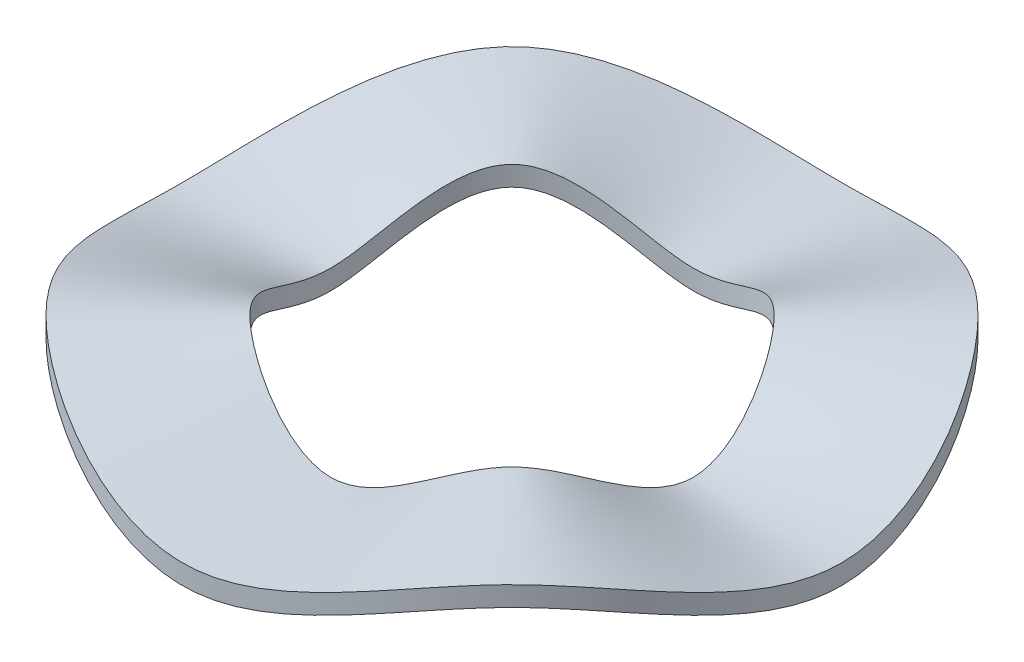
ISO-10303-21;
HEADER;
FILE_DESCRIPTION(('STEP AP214'),'2;1');
FILE_NAME('part.step','',(''),(''),'','','');
FILE_SCHEMA(('AUTOMOTIVE_DESIGN { 1 0 10303 214 1 1 1 1 }'));
ENDSEC;
DATA;
#1=APPLICATION_CONTEXT('core data for automotive mechanical design processes');
#2=APPLICATION_PROTOCOL_DEFINITION('international standard','automotive_design',2000,#1);
#3=PRODUCT_CONTEXT('',#1,'mechanical');
#4=PRODUCT('Part','Part','',(#3));
#5=PRODUCT_RELATED_PRODUCT_CATEGORY('part','',(#4));
#6=PRODUCT_DEFINITION_FORMATION('','',#4);
#7=PRODUCT_DEFINITION_CONTEXT('part definition',#1,'design');
#8=PRODUCT_DEFINITION('design','',#6,#7);
#9=PRODUCT_DEFINITION_SHAPE('','',#8);
#10=(LENGTH_UNIT() NAMED_UNIT(*) SI_UNIT(.MILLI.,.METRE.));
#11=(NAMED_UNIT(*) PLANE_ANGLE_UNIT() SI_UNIT($,.RADIAN.));
#12=(NAMED_UNIT(*) SI_UNIT($,.STERADIAN.) SOLID_ANGLE_UNIT());
#13=UNCERTAINTY_MEASURE_WITH_UNIT(LENGTH_MEASURE(1.E-05),#10,'distance_accuracy_value','');
#14=(GEOMETRIC_REPRESENTATION_CONTEXT(3) GLOBAL_UNCERTAINTY_ASSIGNED_CONTEXT((#13)) GLOBAL_UNIT_ASSIGNED_CONTEXT((#10,
#11,#12)) REPRESENTATION_CONTEXT('',''));
#15=CARTESIAN_POINT('',(0.,0.,0.));
#16=DIRECTION('',(0.,0.,1.));
#17=DIRECTION('',(1.,0.,0.));
#18=AXIS2_PLACEMENT_3D('',#15,#16,#17);
#19=CARTESIAN_POINT('',(13.97,0.,0.));
#20=CARTESIAN_POINT('',(13.969999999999,0.,-0.188853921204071));
#21=CARTESIAN_POINT('',(13.9634030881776,0.0190499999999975,-0.566561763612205));
#22=CARTESIAN_POINT('',(13.9337848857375,0.0990599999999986,-1.13220189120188));
#23=CARTESIAN_POINT('',(13.8845117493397,0.224789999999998,-1.69599874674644));
#24=CARTESIAN_POINT('',(13.4713507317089,1.2192,-5.06219043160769));
#25=CARTESIAN_POINT('',(10.5758195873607,6.858,-11.595111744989));
#26=CARTESIAN_POINT('',(-8.7959153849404E-11,-3.81000000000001,-15.2893823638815));
#27=CARTESIAN_POINT('',(-11.3312352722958,7.62,-11.3312352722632));
#28=CARTESIAN_POINT('',(-15.2893823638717,-3.80999999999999,-3.27185110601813E-12));
#29=CARTESIAN_POINT('',(-11.3312352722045,7.62,11.331235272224));
#30=CARTESIAN_POINT('',(2.29208470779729E-11,-3.81000000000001,15.2893823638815));
#31=CARTESIAN_POINT('',(10.5758195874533,6.858,11.5951117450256));
#32=CARTESIAN_POINT('',(13.4713507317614,1.21919999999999,5.06219043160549));
#33=CARTESIAN_POINT('',(13.8845117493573,0.224789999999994,1.69599874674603));
#34=CARTESIAN_POINT('',(13.9337848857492,0.0990599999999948,1.13220189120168));
#35=CARTESIAN_POINT('',(13.9634030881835,0.0190499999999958,0.566561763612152));
#36=CARTESIAN_POINT('',(13.970000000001,0.,0.188853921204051));
#37=CARTESIAN_POINT('',(13.97,0.,0.));
#38=CARTESIAN_POINT('',(14.9225,0.,0.));
#39=CARTESIAN_POINT('',(14.9224999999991,0.,-0.20076017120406));
#40=CARTESIAN_POINT('',(14.9153077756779,0.0190499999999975,-0.602280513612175));
#41=CARTESIAN_POINT('',(14.8830553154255,0.0990599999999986,-1.20359474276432));
#42=CARTESIAN_POINT('',(14.8294512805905,0.224789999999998,-1.80297640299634));
#43=CARTESIAN_POINT('',(14.3803929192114,1.2192,-5.38187324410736));
#44=CARTESIAN_POINT('',(11.2425695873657,6.858,-12.3332992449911));
#45=CARTESIAN_POINT('',(-8.0629947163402E-11,-3.81000000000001,-16.3609448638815));
#46=CARTESIAN_POINT('',(-12.0456102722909,7.62,-12.045610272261));
#47=CARTESIAN_POINT('',(-16.3609448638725,-3.80999999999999,-2.99949952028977E-12));
#48=CARTESIAN_POINT('',(-12.0456102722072,7.62,12.0456102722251));
#49=CARTESIAN_POINT('',(2.10104828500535E-11,-3.81000000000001,16.3609448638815));
#50=CARTESIAN_POINT('',(11.2425695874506,6.858,12.3332992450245));
#51=CARTESIAN_POINT('',(14.3803929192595,1.21919999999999,5.38187324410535));
#52=CARTESIAN_POINT('',(14.8294512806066,0.224789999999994,1.80297640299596));
#53=CARTESIAN_POINT('',(14.8830553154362,0.0990599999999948,1.20359474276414));
#54=CARTESIAN_POINT('',(14.9153077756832,0.0190499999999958,0.602280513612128));
#55=CARTESIAN_POINT('',(14.9225000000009,0.,0.200760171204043));
#56=CARTESIAN_POINT('',(14.9225,0.,0.));
#57=CARTESIAN_POINT('',(16.8275,0.,0.));
#58=CARTESIAN_POINT('',(16.8274999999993,0.,-0.224572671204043));
#59=CARTESIAN_POINT('',(16.8191171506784,0.0190499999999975,-0.673718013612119));
#60=CARTESIAN_POINT('',(16.7815961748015,0.0990599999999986,-1.3463804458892));
#61=CARTESIAN_POINT('',(16.7193303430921,0.224789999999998,-2.01693171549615));
#62=CARTESIAN_POINT('',(16.1984772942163,1.2192,-6.0212388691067));
#63=CARTESIAN_POINT('',(12.5760695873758,6.858,-13.8096742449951));
#64=CARTESIAN_POINT('',(-6.597066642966E-11,-3.81000000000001,-18.5040698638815));
#65=CARTESIAN_POINT('',(-13.4743602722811,7.62,-13.4743602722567));
#66=CARTESIAN_POINT('',(-18.5040698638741,-3.80999999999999,-2.45306162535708E-12));
#67=CARTESIAN_POINT('',(-13.4743602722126,7.62,13.4743602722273));
#68=CARTESIAN_POINT('',(1.71880196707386E-11,-3.81000000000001,18.5040698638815));
#69=CARTESIAN_POINT('',(12.5760695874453,6.858,13.8096742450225));
#70=CARTESIAN_POINT('',(16.1984772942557,1.21919999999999,6.02123886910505));
#71=CARTESIAN_POINT('',(16.7193303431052,0.224789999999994,2.01693171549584));
#72=CARTESIAN_POINT('',(16.7815961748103,0.0990599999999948,1.34638044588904));
#73=CARTESIAN_POINT('',(16.8191171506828,0.0190499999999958,0.673718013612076));
#74=CARTESIAN_POINT('',(16.8275000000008,0.,0.224572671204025));
#75=CARTESIAN_POINT('',(16.8275,0.,0.));
#76=CARTESIAN_POINT('',(19.685,0.,0.));
#77=CARTESIAN_POINT('',(19.6849999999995,0.,-0.260291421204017));
#78=CARTESIAN_POINT('',(19.6748312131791,0.0190499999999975,-0.780874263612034));
#79=CARTESIAN_POINT('',(19.6294074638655,0.0990599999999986,-1.56055900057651));
#80=CARTESIAN_POINT('',(19.5541489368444,0.224789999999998,-2.33786468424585));
#81=CARTESIAN_POINT('',(18.9256038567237,1.2192,-6.9802873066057));
#82=CARTESIAN_POINT('',(14.576319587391,6.858,-16.0242367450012));
#83=CARTESIAN_POINT('',(-4.3979576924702E-11,-3.81000000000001,-21.7187573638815));
#84=CARTESIAN_POINT('',(-15.6174852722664,7.62,-15.6174852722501));
#85=CARTESIAN_POINT('',(-21.7187573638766,-3.80999999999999,-1.63817527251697E-12));
#86=CARTESIAN_POINT('',(-15.6174852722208,7.62,15.6174852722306));
#87=CARTESIAN_POINT('',(1.14573606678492E-11,-3.81000000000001,21.7187573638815));
#88=CARTESIAN_POINT('',(14.5763195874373,6.858,16.0242367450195));
#89=CARTESIAN_POINT('',(18.92560385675,1.21919999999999,6.9802873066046));
#90=CARTESIAN_POINT('',(19.5541489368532,0.224789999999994,2.33786468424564));
#91=CARTESIAN_POINT('',(19.6294074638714,0.0990599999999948,1.5605590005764));
#92=CARTESIAN_POINT('',(19.674831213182,0.0190499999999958,0.780874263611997));
#93=CARTESIAN_POINT('',(19.6850000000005,0.,0.260291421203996));
#94=CARTESIAN_POINT('',(19.685,0.,0.));
#95=CARTESIAN_POINT('',(22.5425,0.,0.));
#96=CARTESIAN_POINT('',(22.5424999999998,0.,-0.296010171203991));
#97=CARTESIAN_POINT('',(22.5305452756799,0.0190499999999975,-0.888030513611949));
#98=CARTESIAN_POINT('',(22.4772187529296,0.0990599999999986,-1.77473755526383));
#99=CARTESIAN_POINT('',(22.3889675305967,0.224789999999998,-2.65879765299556));
#100=CARTESIAN_POINT('',(21.6527304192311,1.2192,-7.9393357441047));
#101=CARTESIAN_POINT('',(16.5765695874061,6.858,-18.2387992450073));
#102=CARTESIAN_POINT('',(-2.19936915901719E-11,-3.81000000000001,-24.9334448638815));
#103=CARTESIAN_POINT('',(-17.7606102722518,7.62,-17.7606102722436));
#104=CARTESIAN_POINT('',(-24.933444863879,-3.80999999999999,-8.1418162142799E-13));
#105=CARTESIAN_POINT('',(-17.7606102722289,7.62,17.7606102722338));
#106=CARTESIAN_POINT('',(5.71889540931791E-12,-3.81000000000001,24.9334448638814));
#107=CARTESIAN_POINT('',(16.5765695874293,6.858,18.2387992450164));
#108=CARTESIAN_POINT('',(21.6527304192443,1.21919999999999,7.93933574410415));
#109=CARTESIAN_POINT('',(22.3889675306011,0.224789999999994,2.65879765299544));
#110=CARTESIAN_POINT('',(22.4772187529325,0.0990599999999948,1.77473755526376));
#111=CARTESIAN_POINT('',(22.5305452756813,0.0190499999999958,0.888030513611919));
#112=CARTESIAN_POINT('',(22.5425000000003,0.,0.296010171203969));
#113=CARTESIAN_POINT('',(22.5425,0.,0.));
#114=CARTESIAN_POINT('',(24.4475,0.,0.));
#115=CARTESIAN_POINT('',(24.4474999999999,0.,-0.319822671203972));
#116=CARTESIAN_POINT('',(24.4343546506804,0.0190499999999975,-0.959468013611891));
#117=CARTESIAN_POINT('',(24.3757596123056,0.0990599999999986,-1.91752325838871));
#118=CARTESIAN_POINT('',(24.2788465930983,0.224789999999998,-2.87275296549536));
#119=CARTESIAN_POINT('',(23.4708147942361,1.2192,-8.57870136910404));
#120=CARTESIAN_POINT('',(17.9100695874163,6.858,-19.7151742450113));
#121=CARTESIAN_POINT('',(-7.32920668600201E-12,-3.81000000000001,-27.0765698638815));
#122=CARTESIAN_POINT('',(-19.189360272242,7.62,-19.1893602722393));
#123=CARTESIAN_POINT('',(-27.0765698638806,-3.80999999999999,-2.72947896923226E-13));
#124=CARTESIAN_POINT('',(-19.1893602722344,7.62,19.189360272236));
#125=CARTESIAN_POINT('',(1.90076903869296E-12,-3.81000000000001,27.0765698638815));
#126=CARTESIAN_POINT('',(17.910069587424,6.858,19.7151742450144));
#127=CARTESIAN_POINT('',(23.4708147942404,1.21919999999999,8.57870136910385));
#128=CARTESIAN_POINT('',(24.2788465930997,0.224789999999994,2.87275296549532));
#129=CARTESIAN_POINT('',(24.3757596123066,0.0990599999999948,1.91752325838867));
#130=CARTESIAN_POINT('',(24.4343546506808,0.0190499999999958,0.959468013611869));
#131=CARTESIAN_POINT('',(24.4475000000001,0.,0.319822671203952));
#132=CARTESIAN_POINT('',(24.4475,0.,0.));
#133=CARTESIAN_POINT('',(25.4,0.,0.));
#134=CARTESIAN_POINT('',(25.4,0.,-0.331728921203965));
#135=CARTESIAN_POINT('',(25.3862593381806,0.0190499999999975,-0.995186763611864));
#136=CARTESIAN_POINT('',(25.3250300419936,0.0990599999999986,-1.98891610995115));
#137=CARTESIAN_POINT('',(25.2237861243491,0.224789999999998,-2.97973062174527));
#138=CARTESIAN_POINT('',(24.3798569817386,1.2192,-8.89838418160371));
#139=CARTESIAN_POINT('',(18.5768195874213,6.858,-20.4533617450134));
#140=CARTESIAN_POINT('',(0.,-3.81000000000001,-28.1481323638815));
#141=CARTESIAN_POINT('',(-19.9037352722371,7.62,-19.9037352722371));
#142=CARTESIAN_POINT('',(-28.1481323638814,-3.80999999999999,0.));
#143=CARTESIAN_POINT('',(-19.9037352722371,7.62,19.9037352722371));
#144=CARTESIAN_POINT('',(0.,-3.81000000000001,28.1481323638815));
#145=CARTESIAN_POINT('',(18.5768195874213,6.858,20.4533617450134));
#146=CARTESIAN_POINT('',(24.3798569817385,1.21919999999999,8.8983841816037));
#147=CARTESIAN_POINT('',(25.2237861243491,0.224789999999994,2.97973062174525));
#148=CARTESIAN_POINT('',(25.3250300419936,0.0990599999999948,1.98891610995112));
#149=CARTESIAN_POINT('',(25.3862593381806,0.0190499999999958,0.995186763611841));
#150=CARTESIAN_POINT('',(25.4,0.,0.331728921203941));
#151=CARTESIAN_POINT('',(25.4,0.,0.));
#152=B_SPLINE_SURFACE_WITH_KNOTS('',3,3,((#19,#20,#21,#22,#23,#24,#25,#26,#27,#28,#29,#30,#31,
#32,#33,#34,#35,#36,#37),(#38,#39,#40,#41,#42,#43,#44,#45,#46,#47,#48,#49,#50,#51,#52,#53,#54,
#55,#56),(#57,#58,#59,#60,#61,#62,#63,#64,#65,#66,#67,#68,#69,#70,#71,#72,#73,#74,#75),(#76,#77,
#78,#79,#80,#81,#82,#83,#84,#85,#86,#87,#88,#89,#90,#91,#92,#93,#94),(#95,#96,#97,#98,#99,#100,
#101,#102,#103,#104,#105,#106,#107,#108,#109,#110,#111,#112,#113),(#114,#115,#116,#117,#118,
#119,#120,#121,#122,#123,#124,#125,#126,#127,#128,#129,#130,#131,#132),(#133,#134,#135,#136,
#137,#138,#139,#140,#141,#142,#143,#144,#145,#146,#147,#148,#149,#150,#151)),.UNSPECIFIED.,.F.,
.T.,.F.,(4,1,1,1,4),(4,1,1,1,1,1,1,1,1,1,1,1,1,1,1,1,4),(0.558823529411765,0.669117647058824,
0.779411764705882,0.889705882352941,1.),(0.,0.00625000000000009,0.0125,0.01875,
0.0249999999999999,0.125,0.25000000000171,0.375,0.5,0.625,0.750000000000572,0.875,0.975,0.98125,
0.9875,0.99375,1.),.UNSPECIFIED.);
#153=CARTESIAN_POINT('',(25.4,0.,0.));
#154=CARTESIAN_POINT('',(25.4,0.,-0.331728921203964));
#155=CARTESIAN_POINT('',(25.3862593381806,0.0190499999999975,-0.995186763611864));
#156=CARTESIAN_POINT('',(25.3250300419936,0.0990599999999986,-1.98891610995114));
#157=CARTESIAN_POINT('',(25.2237861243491,0.224789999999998,-2.97973062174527));
#158=CARTESIAN_POINT('',(24.3798569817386,1.2192,-8.89838418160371));
#159=CARTESIAN_POINT('',(18.5768195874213,6.858,-20.4533617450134));
#160=CARTESIAN_POINT('',(0.,-3.81000000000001,-28.1481323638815));
#161=CARTESIAN_POINT('',(-19.9037352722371,7.62,-19.9037352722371));
#162=CARTESIAN_POINT('',(-28.1481323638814,-3.80999999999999,0.));
#163=CARTESIAN_POINT('',(-19.9037352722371,7.62,19.9037352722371));
#164=CARTESIAN_POINT('',(0.,-3.81000000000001,28.1481323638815));
#165=CARTESIAN_POINT('',(18.5768195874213,6.858,20.4533617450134));
#166=CARTESIAN_POINT('',(24.3798569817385,1.21919999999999,8.8983841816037));
#167=CARTESIAN_POINT('',(25.2237861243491,0.224789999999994,2.97973062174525));
#168=CARTESIAN_POINT('',(25.3250300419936,0.0990599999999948,1.98891610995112));
#169=CARTESIAN_POINT('',(25.3862593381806,0.0190499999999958,0.995186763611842));
#170=CARTESIAN_POINT('',(25.4,0.,0.331728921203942));
#171=CARTESIAN_POINT('',(25.4,0.,0.));
#172=B_SPLINE_CURVE_WITH_KNOTS('',3,(#153,#154,#155,#156,#157,#158,#159,#160,#161,#162,#163,
#164,#165,#166,#167,#168,#169,#170,#171),.UNSPECIFIED.,.T.,.F.,(4,1,1,1,1,1,1,1,1,1,1,1,1,1,1,1,
4),(0.,0.00625000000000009,0.0125,0.01875,0.0249999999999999,0.125,0.25000000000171,0.375,0.5,
0.625,0.750000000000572,0.875,0.975,0.98125,0.9875,0.99375,1.),.UNSPECIFIED.);
#173=CARTESIAN_POINT('',(25.4,0.,0.));
#174=VERTEX_POINT('',#173);
#175=EDGE_CURVE('E11',#174,#174,#172,.T.);
#176=CARTESIAN_POINT('',(13.97,0.,0.));
#177=CARTESIAN_POINT('',(13.969999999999,0.,-0.188853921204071));
#178=CARTESIAN_POINT('',(13.9634030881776,0.0190499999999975,-0.566561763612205));
#179=CARTESIAN_POINT('',(13.9337848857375,0.0990599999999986,-1.13220189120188));
#180=CARTESIAN_POINT('',(13.8845117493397,0.224789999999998,-1.69599874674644));
#181=CARTESIAN_POINT('',(13.4713507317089,1.2192,-5.06219043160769));
#182=CARTESIAN_POINT('',(10.5758195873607,6.858,-11.595111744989));
#183=CARTESIAN_POINT('',(-8.7959153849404E-11,-3.81000000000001,-15.2893823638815));
#184=CARTESIAN_POINT('',(-11.3312352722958,7.62,-11.3312352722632));
#185=CARTESIAN_POINT('',(-15.2893823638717,-3.80999999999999,-3.27185110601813E-12));
#186=CARTESIAN_POINT('',(-11.3312352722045,7.62,11.331235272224));
#187=CARTESIAN_POINT('',(2.29208470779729E-11,-3.81000000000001,15.2893823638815));
#188=CARTESIAN_POINT('',(10.5758195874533,6.858,11.5951117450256));
#189=CARTESIAN_POINT('',(13.4713507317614,1.21919999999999,5.06219043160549));
#190=CARTESIAN_POINT('',(13.8845117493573,0.224789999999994,1.69599874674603));
#191=CARTESIAN_POINT('',(13.9337848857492,0.0990599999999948,1.13220189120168));
#192=CARTESIAN_POINT('',(13.9634030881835,0.0190499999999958,0.566561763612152));
#193=CARTESIAN_POINT('',(13.970000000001,0.,0.188853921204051));
#194=CARTESIAN_POINT('',(13.97,0.,0.));
#195=B_SPLINE_CURVE_WITH_KNOTS('',3,(#176,#177,#178,#179,#180,#181,#182,#183,#184,#185,#186,
#187,#188,#189,#190,#191,#192,#193,#194),.UNSPECIFIED.,.T.,.F.,(4,1,1,1,1,1,1,1,1,1,1,1,1,1,1,1,
4),(0.,0.00625000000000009,0.0125,0.01875,0.0249999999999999,0.125,0.25000000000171,0.375,0.5,
0.625,0.750000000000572,0.875,0.975,0.98125,0.9875,0.99375,1.),.UNSPECIFIED.);
#196=CARTESIAN_POINT('',(13.97,0.,0.));
#197=VERTEX_POINT('',#196);
#198=EDGE_CURVE('E42',#197,#197,#195,.T.);
#199=ORIENTED_EDGE('',*,*,#175,.T.);
#200=EDGE_LOOP('',(#199));
#201=FACE_BOUND('',#200,.T.);
#202=ORIENTED_EDGE('',*,*,#198,.F.);
#203=EDGE_LOOP('',(#202));
#204=FACE_BOUND('',#203,.T.);
#205=ADVANCED_FACE('F37',(#201,#204),#152,.T.);
#206=CARTESIAN_POINT('',(13.97,-1.524,0.));
#207=CARTESIAN_POINT('',(13.969999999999,-1.524,-0.18885392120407));
#208=CARTESIAN_POINT('',(13.9634030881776,-1.50495,-0.566561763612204));
#209=CARTESIAN_POINT('',(13.9337848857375,-1.42494,-1.13220189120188));
#210=CARTESIAN_POINT('',(13.8845117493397,-1.29921,-1.69599874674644));
#211=CARTESIAN_POINT('',(13.4713507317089,-0.3048,-5.06219043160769));
#212=CARTESIAN_POINT('',(10.5758195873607,5.334,-11.595111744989));
#213=CARTESIAN_POINT('',(-8.7959587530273E-11,-5.33400000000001,-15.2893823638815));
#214=CARTESIAN_POINT('',(-11.3312352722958,6.096,-11.3312352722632));
#215=CARTESIAN_POINT('',(-15.2893823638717,-5.33399999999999,-3.27098374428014E-12));
#216=CARTESIAN_POINT('',(-11.3312352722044,6.096,11.331235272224));
#217=CARTESIAN_POINT('',(2.29212807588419E-11,-5.33400000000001,15.2893823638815));
#218=CARTESIAN_POINT('',(10.5758195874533,5.334,11.5951117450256));
#219=CARTESIAN_POINT('',(13.4713507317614,-0.304800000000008,5.06219043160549));
#220=CARTESIAN_POINT('',(13.8845117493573,-1.29921000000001,1.69599874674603));
#221=CARTESIAN_POINT('',(13.9337848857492,-1.42494000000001,1.13220189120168));
#222=CARTESIAN_POINT('',(13.9634030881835,-1.50495,0.566561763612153));
#223=CARTESIAN_POINT('',(13.970000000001,-1.524,0.188853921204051));
#224=CARTESIAN_POINT('',(13.97,-1.524,0.));
#225=CARTESIAN_POINT('',(13.97,-1.397,0.));
#226=CARTESIAN_POINT('',(13.969999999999,-1.397,-0.18885392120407));
#227=CARTESIAN_POINT('',(13.9634030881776,-1.37795,-0.566561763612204));
#228=CARTESIAN_POINT('',(13.9337848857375,-1.29794,-1.13220189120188));
#229=CARTESIAN_POINT('',(13.8845117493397,-1.17221,-1.69599874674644));
#230=CARTESIAN_POINT('',(13.4713507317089,-0.1778,-5.06219043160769));
#231=CARTESIAN_POINT('',(10.5758195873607,5.461,-11.595111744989));
#232=CARTESIAN_POINT('',(-8.7959587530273E-11,-5.20700000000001,-15.2893823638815));
#233=CARTESIAN_POINT('',(-11.3312352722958,6.223,-11.3312352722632));
#234=CARTESIAN_POINT('',(-15.2893823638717,-5.20699999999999,-3.27098374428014E-12));
#235=CARTESIAN_POINT('',(-11.3312352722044,6.223,11.331235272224));
#236=CARTESIAN_POINT('',(2.29212807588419E-11,-5.20700000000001,15.2893823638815));
#237=CARTESIAN_POINT('',(10.5758195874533,5.461,11.5951117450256));
#238=CARTESIAN_POINT('',(13.4713507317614,-0.177800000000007,5.06219043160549));
#239=CARTESIAN_POINT('',(13.8845117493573,-1.17221000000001,1.69599874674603));
#240=CARTESIAN_POINT('',(13.9337848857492,-1.29794,1.13220189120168));
#241=CARTESIAN_POINT('',(13.9634030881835,-1.37795,0.566561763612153));
#242=CARTESIAN_POINT('',(13.970000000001,-1.397,0.188853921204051));
#243=CARTESIAN_POINT('',(13.97,-1.397,0.));
#244=CARTESIAN_POINT('',(13.97,-1.143,0.));
#245=CARTESIAN_POINT('',(13.9699999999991,-1.143,-0.188853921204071));
#246=CARTESIAN_POINT('',(13.9634030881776,-1.12395,-0.566561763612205));
#247=CARTESIAN_POINT('',(13.9337848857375,-1.04394,-1.13220189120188));
#248=CARTESIAN_POINT('',(13.8845117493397,-0.918210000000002,-1.69599874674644));
#249=CARTESIAN_POINT('',(13.4713507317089,0.0761999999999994,-5.06219043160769));
#250=CARTESIAN_POINT('',(10.5758195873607,5.715,-11.5951117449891));
#251=CARTESIAN_POINT('',(-8.7960454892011E-11,-4.95300000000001,-15.2893823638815));
#252=CARTESIAN_POINT('',(-11.3312352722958,6.477,-11.3312352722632));
#253=CARTESIAN_POINT('',(-15.2893823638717,-4.95299999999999,-3.27098374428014E-12));
#254=CARTESIAN_POINT('',(-11.3312352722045,6.477,11.331235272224));
#255=CARTESIAN_POINT('',(2.29199797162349E-11,-4.95300000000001,15.2893823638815));
#256=CARTESIAN_POINT('',(10.5758195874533,5.715,11.5951117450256));
#257=CARTESIAN_POINT('',(13.4713507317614,0.076199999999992,5.0621904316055));
#258=CARTESIAN_POINT('',(13.8845117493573,-0.918210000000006,1.69599874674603));
#259=CARTESIAN_POINT('',(13.9337848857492,-1.04394000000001,1.13220189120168));
#260=CARTESIAN_POINT('',(13.9634030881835,-1.12395000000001,0.566561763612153));
#261=CARTESIAN_POINT('',(13.970000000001,-1.143,0.188853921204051));
#262=CARTESIAN_POINT('',(13.97,-1.143,0.));
#263=CARTESIAN_POINT('',(13.97,-0.762000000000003,0.));
#264=CARTESIAN_POINT('',(13.969999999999,-0.762000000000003,-0.18885392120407));
#265=CARTESIAN_POINT('',(13.9634030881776,-0.742950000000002,-0.566561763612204));
#266=CARTESIAN_POINT('',(13.9337848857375,-0.662940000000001,-1.13220189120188));
#267=CARTESIAN_POINT('',(13.8845117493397,-0.537210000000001,-1.69599874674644));
#268=CARTESIAN_POINT('',(13.4713507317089,0.4572,-5.06219043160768));
#269=CARTESIAN_POINT('',(10.5758195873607,6.096,-11.595111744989));
#270=CARTESIAN_POINT('',(-8.7959587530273E-11,-4.57200000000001,-15.2893823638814));
#271=CARTESIAN_POINT('',(-11.3312352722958,6.858,-11.3312352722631));
#272=CARTESIAN_POINT('',(-15.2893823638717,-4.57199999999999,-3.27185110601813E-12));
#273=CARTESIAN_POINT('',(-11.3312352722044,6.858,11.331235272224));
#274=CARTESIAN_POINT('',(2.29217144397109E-11,-4.57200000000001,15.2893823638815));
#275=CARTESIAN_POINT('',(10.5758195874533,6.096,11.5951117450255));
#276=CARTESIAN_POINT('',(13.4713507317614,0.457199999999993,5.06219043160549));
#277=CARTESIAN_POINT('',(13.8845117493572,-0.537210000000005,1.69599874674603));
#278=CARTESIAN_POINT('',(13.9337848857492,-0.662940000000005,1.13220189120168));
#279=CARTESIAN_POINT('',(13.9634030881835,-0.742950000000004,0.566561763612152));
#280=CARTESIAN_POINT('',(13.970000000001,-0.762000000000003,0.188853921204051));
#281=CARTESIAN_POINT('',(13.97,-0.762000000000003,0.));
#282=CARTESIAN_POINT('',(13.97,-0.381000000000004,0.));
#283=CARTESIAN_POINT('',(13.969999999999,-0.381000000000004,-0.18885392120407));
#284=CARTESIAN_POINT('',(13.9634030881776,-0.361950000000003,-0.566561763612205));
#285=CARTESIAN_POINT('',(13.9337848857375,-0.281940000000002,-1.13220189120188));
#286=CARTESIAN_POINT('',(13.8845117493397,-0.156210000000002,-1.69599874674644));
#287=CARTESIAN_POINT('',(13.4713507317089,0.8382,-5.0621904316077));
#288=CARTESIAN_POINT('',(10.5758195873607,6.477,-11.5951117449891));
#289=CARTESIAN_POINT('',(-8.7959587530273E-11,-4.19100000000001,-15.2893823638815));
#290=CARTESIAN_POINT('',(-11.3312352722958,7.239,-11.3312352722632));
#291=CARTESIAN_POINT('',(-15.2893823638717,-4.19099999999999,-3.27055006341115E-12));
#292=CARTESIAN_POINT('',(-11.3312352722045,7.239,11.331235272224));
#293=CARTESIAN_POINT('',(2.29208470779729E-11,-4.19100000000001,15.2893823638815));
#294=CARTESIAN_POINT('',(10.5758195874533,6.477,11.5951117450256));
#295=CARTESIAN_POINT('',(13.4713507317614,0.838199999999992,5.0621904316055));
#296=CARTESIAN_POINT('',(13.8845117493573,-0.156210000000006,1.69599874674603));
#297=CARTESIAN_POINT('',(13.9337848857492,-0.281940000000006,1.13220189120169));
#298=CARTESIAN_POINT('',(13.9634030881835,-0.361950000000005,0.566561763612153));
#299=CARTESIAN_POINT('',(13.970000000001,-0.381000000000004,0.188853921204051));
#300=CARTESIAN_POINT('',(13.97,-0.381000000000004,0.));
#301=CARTESIAN_POINT('',(13.97,-0.127000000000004,0.));
#302=CARTESIAN_POINT('',(13.969999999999,-0.127000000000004,-0.188853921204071));
#303=CARTESIAN_POINT('',(13.9634030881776,-0.107950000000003,-0.566561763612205));
#304=CARTESIAN_POINT('',(13.9337848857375,-0.0279400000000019,-1.13220189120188));
#305=CARTESIAN_POINT('',(13.8845117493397,0.0977899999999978,-1.69599874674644));
#306=CARTESIAN_POINT('',(13.4713507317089,1.0922,-5.06219043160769));
#307=CARTESIAN_POINT('',(10.5758195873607,6.731,-11.595111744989));
#308=CARTESIAN_POINT('',(-8.7959153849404E-11,-3.93700000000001,-15.2893823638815));
#309=CARTESIAN_POINT('',(-11.3312352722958,7.493,-11.3312352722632));
#310=CARTESIAN_POINT('',(-15.2893823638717,-3.93699999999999,-3.27185110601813E-12));
#311=CARTESIAN_POINT('',(-11.3312352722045,7.493,11.331235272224));
#312=CARTESIAN_POINT('',(2.29208470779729E-11,-3.93700000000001,15.2893823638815));
#313=CARTESIAN_POINT('',(10.5758195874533,6.731,11.5951117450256));
#314=CARTESIAN_POINT('',(13.4713507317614,1.09219999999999,5.06219043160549));
#315=CARTESIAN_POINT('',(13.8845117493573,0.0977899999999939,1.69599874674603));
#316=CARTESIAN_POINT('',(13.9337848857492,-0.0279400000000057,1.13220189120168));
#317=CARTESIAN_POINT('',(13.9634030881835,-0.107950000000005,0.566561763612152));
#318=CARTESIAN_POINT('',(13.970000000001,-0.127000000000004,0.188853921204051));
#319=CARTESIAN_POINT('',(13.97,-0.127000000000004,0.));
#320=CARTESIAN_POINT('',(13.97,0.,0.));
#321=CARTESIAN_POINT('',(13.969999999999,0.,-0.188853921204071));
#322=CARTESIAN_POINT('',(13.9634030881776,0.0190499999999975,-0.566561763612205));
#323=CARTESIAN_POINT('',(13.9337848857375,0.0990599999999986,-1.13220189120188));
#324=CARTESIAN_POINT('',(13.8845117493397,0.224789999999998,-1.69599874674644));
#325=CARTESIAN_POINT('',(13.4713507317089,1.2192,-5.06219043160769));
#326=CARTESIAN_POINT('',(10.5758195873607,6.858,-11.595111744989));
#327=CARTESIAN_POINT('',(-8.7959153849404E-11,-3.81000000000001,-15.2893823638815));
#328=CARTESIAN_POINT('',(-11.3312352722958,7.62,-11.3312352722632));
#329=CARTESIAN_POINT('',(-15.2893823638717,-3.80999999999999,-3.27185110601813E-12));
#330=CARTESIAN_POINT('',(-11.3312352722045,7.62,11.331235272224));
#331=CARTESIAN_POINT('',(2.29208470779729E-11,-3.81000000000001,15.2893823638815));
#332=CARTESIAN_POINT('',(10.5758195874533,6.858,11.5951117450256));
#333=CARTESIAN_POINT('',(13.4713507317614,1.21919999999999,5.06219043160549));
#334=CARTESIAN_POINT('',(13.8845117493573,0.224789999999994,1.69599874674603));
#335=CARTESIAN_POINT('',(13.9337848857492,0.0990599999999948,1.13220189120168));
#336=CARTESIAN_POINT('',(13.9634030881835,0.0190499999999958,0.566561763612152));
#337=CARTESIAN_POINT('',(13.970000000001,0.,0.188853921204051));
#338=CARTESIAN_POINT('',(13.97,0.,0.));
#339=B_SPLINE_SURFACE_WITH_KNOTS('',3,3,((#206,#207,#208,#209,#210,#211,#212,#213,#214,#215,
#216,#217,#218,#219,#220,#221,#222,#223,#224),(#225,#226,#227,#228,#229,#230,#231,#232,#233,
#234,#235,#236,#237,#238,#239,#240,#241,#242,#243),(#244,#245,#246,#247,#248,#249,#250,#251,
#252,#253,#254,#255,#256,#257,#258,#259,#260,#261,#262),(#263,#264,#265,#266,#267,#268,#269,
#270,#271,#272,#273,#274,#275,#276,#277,#278,#279,#280,#281),(#282,#283,#284,#285,#286,#287,
#288,#289,#290,#291,#292,#293,#294,#295,#296,#297,#298,#299,#300),(#301,#302,#303,#304,#305,
#306,#307,#308,#309,#310,#311,#312,#313,#314,#315,#316,#317,#318,#319),(#320,#321,#322,#323,
#324,#325,#326,#327,#328,#329,#330,#331,#332,#333,#334,#335,#336,#337,#338)),.UNSPECIFIED.,.F.,
.T.,.F.,(4,1,1,1,4),(4,1,1,1,1,1,1,1,1,1,1,1,1,1,1,1,4),(0.5,0.514705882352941,
0.529411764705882,0.544117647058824,0.558823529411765),(0.,0.00625000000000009,0.0125,0.01875,
0.0249999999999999,0.125,0.25000000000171,0.375,0.5,0.625,0.750000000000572,0.875,0.975,0.98125,
0.9875,0.99375,1.),.UNSPECIFIED.);
#340=CARTESIAN_POINT('',(13.97,-1.524,0.));
#341=CARTESIAN_POINT('',(13.969999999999,-1.524,-0.18885392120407));
#342=CARTESIAN_POINT('',(13.9634030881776,-1.50495,-0.566561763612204));
#343=CARTESIAN_POINT('',(13.9337848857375,-1.42494,-1.13220189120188));
#344=CARTESIAN_POINT('',(13.8845117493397,-1.29921,-1.69599874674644));
#345=CARTESIAN_POINT('',(13.4713507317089,-0.3048,-5.06219043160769));
#346=CARTESIAN_POINT('',(10.5758195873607,5.334,-11.595111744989));
#347=CARTESIAN_POINT('',(-8.7959587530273E-11,-5.33400000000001,-15.2893823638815));
#348=CARTESIAN_POINT('',(-11.3312352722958,6.096,-11.3312352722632));
#349=CARTESIAN_POINT('',(-15.2893823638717,-5.33399999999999,-3.27098374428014E-12));
#350=CARTESIAN_POINT('',(-11.3312352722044,6.096,11.331235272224));
#351=CARTESIAN_POINT('',(2.29212807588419E-11,-5.33400000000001,15.2893823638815));
#352=CARTESIAN_POINT('',(10.5758195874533,5.334,11.5951117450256));
#353=CARTESIAN_POINT('',(13.4713507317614,-0.304800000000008,5.06219043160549));
#354=CARTESIAN_POINT('',(13.8845117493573,-1.29921000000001,1.69599874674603));
#355=CARTESIAN_POINT('',(13.9337848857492,-1.42494000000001,1.13220189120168));
#356=CARTESIAN_POINT('',(13.9634030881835,-1.50495,0.566561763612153));
#357=CARTESIAN_POINT('',(13.970000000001,-1.524,0.188853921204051));
#358=CARTESIAN_POINT('',(13.97,-1.524,0.));
#359=B_SPLINE_CURVE_WITH_KNOTS('',3,(#340,#341,#342,#343,#344,#345,#346,#347,#348,#349,#350,
#351,#352,#353,#354,#355,#356,#357,#358),.UNSPECIFIED.,.T.,.F.,(4,1,1,1,1,1,1,1,1,1,1,1,1,1,1,1,
4),(0.,0.00625000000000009,0.0125,0.01875,0.0249999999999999,0.125,0.25000000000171,0.375,0.5,
0.625,0.750000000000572,0.875,0.975,0.98125,0.9875,0.99375,1.),.UNSPECIFIED.);
#360=CARTESIAN_POINT('',(13.97,-1.524,0.));
#361=VERTEX_POINT('',#360);
#362=EDGE_CURVE('E52',#361,#361,#359,.T.);
#363=ORIENTED_EDGE('',*,*,#198,.T.);
#364=EDGE_LOOP('',(#363));
#365=FACE_BOUND('',#364,.T.);
#366=ORIENTED_EDGE('',*,*,#362,.F.);
#367=EDGE_LOOP('',(#366));
#368=FACE_BOUND('',#367,.T.);
#369=ADVANCED_FACE('F77',(#365,#368),#339,.T.);
#370=CARTESIAN_POINT('',(25.4,-1.524,0.));
#371=CARTESIAN_POINT('',(25.4,-1.524,-0.331728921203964));
#372=CARTESIAN_POINT('',(25.3862593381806,-1.50495,-0.995186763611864));
#373=CARTESIAN_POINT('',(25.3250300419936,-1.42494,-1.98891610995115));
#374=CARTESIAN_POINT('',(25.2237861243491,-1.29921,-2.97973062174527));
#375=CARTESIAN_POINT('',(24.3798569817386,-0.3048,-8.89838418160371));
#376=CARTESIAN_POINT('',(18.5768195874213,5.334,-20.4533617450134));
#377=CARTESIAN_POINT('',(0.,-5.33400000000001,-28.1481323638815));
#378=CARTESIAN_POINT('',(-19.9037352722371,6.096,-19.9037352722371));
#379=CARTESIAN_POINT('',(-28.1481323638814,-5.33399999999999,0.));
#380=CARTESIAN_POINT('',(-19.9037352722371,6.096,19.9037352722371));
#381=CARTESIAN_POINT('',(0.,-5.33400000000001,28.1481323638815));
#382=CARTESIAN_POINT('',(18.5768195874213,5.334,20.4533617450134));
#383=CARTESIAN_POINT('',(24.3798569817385,-0.304800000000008,8.8983841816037));
#384=CARTESIAN_POINT('',(25.2237861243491,-1.29921000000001,2.97973062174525));
#385=CARTESIAN_POINT('',(25.3250300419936,-1.42494000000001,1.98891610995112));
#386=CARTESIAN_POINT('',(25.3862593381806,-1.50495,0.995186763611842));
#387=CARTESIAN_POINT('',(25.4,-1.524,0.331728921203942));
#388=CARTESIAN_POINT('',(25.4,-1.524,0.));
#389=CARTESIAN_POINT('',(24.4475,-1.524,0.));
#390=CARTESIAN_POINT('',(24.4474999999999,-1.524,-0.319822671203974));
#391=CARTESIAN_POINT('',(24.4343546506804,-1.50495,-0.959468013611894));
#392=CARTESIAN_POINT('',(24.3757596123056,-1.42494,-1.91752325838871));
#393=CARTESIAN_POINT('',(24.2788465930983,-1.29921,-2.87275296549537));
#394=CARTESIAN_POINT('',(23.4708147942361,-0.3048,-8.57870136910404));
#395=CARTESIAN_POINT('',(17.9100695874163,5.334,-19.7151742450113));
#396=CARTESIAN_POINT('',(-7.33180877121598E-12,-5.33400000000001,-27.0765698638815));
#397=CARTESIAN_POINT('',(-19.189360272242,6.096,-19.1893602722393));
#398=CARTESIAN_POINT('',(-27.0765698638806,-5.33399999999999,-2.70345811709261E-13));
#399=CARTESIAN_POINT('',(-19.1893602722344,6.096,19.189360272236));
#400=CARTESIAN_POINT('',(1.89990167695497E-12,-5.33400000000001,27.0765698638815));
#401=CARTESIAN_POINT('',(17.910069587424,5.334,19.7151742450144));
#402=CARTESIAN_POINT('',(23.4708147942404,-0.304800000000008,8.57870136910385));
#403=CARTESIAN_POINT('',(24.2788465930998,-1.29921000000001,2.87275296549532));
#404=CARTESIAN_POINT('',(24.3757596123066,-1.42494000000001,1.91752325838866));
#405=CARTESIAN_POINT('',(24.4343546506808,-1.50495,0.959468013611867));
#406=CARTESIAN_POINT('',(24.4475000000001,-1.524,0.31982267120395));
#407=CARTESIAN_POINT('',(24.4475,-1.524,0.));
#408=CARTESIAN_POINT('',(22.5425,-1.524,0.));
#409=CARTESIAN_POINT('',(22.5424999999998,-1.524,-0.296010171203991));
#410=CARTESIAN_POINT('',(22.5305452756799,-1.50495,-0.88803051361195));
#411=CARTESIAN_POINT('',(22.4772187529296,-1.42494,-1.77473755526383));
#412=CARTESIAN_POINT('',(22.3889675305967,-1.29921,-2.65879765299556));
#413=CARTESIAN_POINT('',(21.6527304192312,-0.3048,-7.93933574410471));
#414=CARTESIAN_POINT('',(16.5765695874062,5.334,-18.2387992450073));
#415=CARTESIAN_POINT('',(-2.19936915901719E-11,-5.33400000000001,-24.9334448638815));
#416=CARTESIAN_POINT('',(-17.7606102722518,6.096,-17.7606102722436));
#417=CARTESIAN_POINT('',(-24.933444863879,-5.33399999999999,-8.15048983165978E-13));
#418=CARTESIAN_POINT('',(-17.7606102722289,6.096,17.7606102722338));
#419=CARTESIAN_POINT('',(5.72063013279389E-12,-5.33400000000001,24.9334448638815));
#420=CARTESIAN_POINT('',(16.5765695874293,5.334,18.2387992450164));
#421=CARTESIAN_POINT('',(21.6527304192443,-0.304800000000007,7.93933574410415));
#422=CARTESIAN_POINT('',(22.3889675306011,-1.29921000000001,2.65879765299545));
#423=CARTESIAN_POINT('',(22.4772187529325,-1.42494,1.77473755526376));
#424=CARTESIAN_POINT('',(22.5305452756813,-1.50495,0.888030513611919));
#425=CARTESIAN_POINT('',(22.5425000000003,-1.524,0.296010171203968));
#426=CARTESIAN_POINT('',(22.5425,-1.524,0.));
#427=CARTESIAN_POINT('',(19.685,-1.524,0.));
#428=CARTESIAN_POINT('',(19.6849999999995,-1.524,-0.260291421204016));
#429=CARTESIAN_POINT('',(19.6748312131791,-1.50495,-0.780874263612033));
#430=CARTESIAN_POINT('',(19.6294074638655,-1.42494,-1.56055900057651));
#431=CARTESIAN_POINT('',(19.5541489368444,-1.29921,-2.33786468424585));
#432=CARTESIAN_POINT('',(18.9256038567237,-0.304800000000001,-6.9802873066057));
#433=CARTESIAN_POINT('',(14.576319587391,5.334,-16.0242367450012));
#434=CARTESIAN_POINT('',(-4.3979576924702E-11,-5.33400000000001,-21.7187573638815));
#435=CARTESIAN_POINT('',(-15.6174852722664,6.096,-15.6174852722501));
#436=CARTESIAN_POINT('',(-21.7187573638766,-5.33399999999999,-1.636440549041E-12));
#437=CARTESIAN_POINT('',(-15.6174852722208,6.096,15.6174852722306));
#438=CARTESIAN_POINT('',(1.14569269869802E-11,-5.33400000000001,21.7187573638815));
#439=CARTESIAN_POINT('',(14.5763195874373,5.334,16.0242367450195));
#440=CARTESIAN_POINT('',(18.92560385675,-0.304800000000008,6.9802873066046));
#441=CARTESIAN_POINT('',(19.5541489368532,-1.29921000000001,2.33786468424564));
#442=CARTESIAN_POINT('',(19.6294074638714,-1.42494000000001,1.5605590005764));
#443=CARTESIAN_POINT('',(19.674831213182,-1.50495,0.780874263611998));
#444=CARTESIAN_POINT('',(19.6850000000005,-1.524,0.260291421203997));
#445=CARTESIAN_POINT('',(19.685,-1.524,0.));
#446=CARTESIAN_POINT('',(16.8275,-1.524,0.));
#447=CARTESIAN_POINT('',(16.8274999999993,-1.524,-0.224572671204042));
#448=CARTESIAN_POINT('',(16.8191171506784,-1.50495,-0.673718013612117));
#449=CARTESIAN_POINT('',(16.7815961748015,-1.42494,-1.34638044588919));
#450=CARTESIAN_POINT('',(16.719330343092,-1.29921,-2.01693171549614));
#451=CARTESIAN_POINT('',(16.1984772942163,-0.3048,-6.02123886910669));
#452=CARTESIAN_POINT('',(12.5760695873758,5.334,-13.8096742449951));
#453=CARTESIAN_POINT('',(-6.597066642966E-11,-5.33400000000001,-18.5040698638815));
#454=CARTESIAN_POINT('',(-13.4743602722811,6.096,-13.4743602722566));
#455=CARTESIAN_POINT('',(-18.5040698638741,-5.33399999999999,-2.45306162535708E-12));
#456=CARTESIAN_POINT('',(-13.4743602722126,6.096,13.4743602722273));
#457=CARTESIAN_POINT('',(1.71867186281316E-11,-5.33400000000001,18.5040698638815));
#458=CARTESIAN_POINT('',(12.5760695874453,5.334,13.8096742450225));
#459=CARTESIAN_POINT('',(16.1984772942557,-0.304800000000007,6.02123886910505));
#460=CARTESIAN_POINT('',(16.7193303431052,-1.29921000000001,2.01693171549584));
#461=CARTESIAN_POINT('',(16.7815961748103,-1.42494000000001,1.34638044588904));
#462=CARTESIAN_POINT('',(16.8191171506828,-1.50495,0.673718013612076));
#463=CARTESIAN_POINT('',(16.8275000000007,-1.524,0.224572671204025));
#464=CARTESIAN_POINT('',(16.8275,-1.524,0.));
#465=CARTESIAN_POINT('',(14.9225,-1.524,0.));
#466=CARTESIAN_POINT('',(14.9224999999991,-1.524,-0.20076017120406));
#467=CARTESIAN_POINT('',(14.9153077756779,-1.50495,-0.602280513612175));
#468=CARTESIAN_POINT('',(14.8830553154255,-1.42494,-1.20359474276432));
#469=CARTESIAN_POINT('',(14.8294512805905,-1.29921,-1.80297640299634));
#470=CARTESIAN_POINT('',(14.3803929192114,-0.3048,-5.38187324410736));
#471=CARTESIAN_POINT('',(11.2425695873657,5.334,-12.3332992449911));
#472=CARTESIAN_POINT('',(-8.0630380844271E-11,-5.33400000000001,-16.3609448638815));
#473=CARTESIAN_POINT('',(-12.0456102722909,6.096,-12.045610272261));
#474=CARTESIAN_POINT('',(-16.3609448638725,-5.33399999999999,-2.99819847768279E-12));
#475=CARTESIAN_POINT('',(-12.0456102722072,6.096,12.0456102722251));
#476=CARTESIAN_POINT('',(2.10100491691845E-11,-5.33400000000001,16.3609448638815));
#477=CARTESIAN_POINT('',(11.2425695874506,5.334,12.3332992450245));
#478=CARTESIAN_POINT('',(14.3803929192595,-0.304800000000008,5.38187324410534));
#479=CARTESIAN_POINT('',(14.8294512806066,-1.29921000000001,1.80297640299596));
#480=CARTESIAN_POINT('',(14.8830553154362,-1.42494000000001,1.20359474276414));
#481=CARTESIAN_POINT('',(14.9153077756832,-1.50495,0.602280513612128));
#482=CARTESIAN_POINT('',(14.9225000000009,-1.524,0.200760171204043));
#483=CARTESIAN_POINT('',(14.9225,-1.524,0.));
#484=CARTESIAN_POINT('',(13.97,-1.524,0.));
#485=CARTESIAN_POINT('',(13.969999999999,-1.524,-0.18885392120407));
#486=CARTESIAN_POINT('',(13.9634030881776,-1.50495,-0.566561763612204));
#487=CARTESIAN_POINT('',(13.9337848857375,-1.42494,-1.13220189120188));
#488=CARTESIAN_POINT('',(13.8845117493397,-1.29921,-1.69599874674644));
#489=CARTESIAN_POINT('',(13.4713507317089,-0.3048,-5.06219043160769));
#490=CARTESIAN_POINT('',(10.5758195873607,5.334,-11.595111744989));
#491=CARTESIAN_POINT('',(-8.7959587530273E-11,-5.33400000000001,-15.2893823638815));
#492=CARTESIAN_POINT('',(-11.3312352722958,6.096,-11.3312352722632));
#493=CARTESIAN_POINT('',(-15.2893823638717,-5.33399999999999,-3.27098374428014E-12));
#494=CARTESIAN_POINT('',(-11.3312352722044,6.096,11.331235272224));
#495=CARTESIAN_POINT('',(2.29212807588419E-11,-5.33400000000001,15.2893823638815));
#496=CARTESIAN_POINT('',(10.5758195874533,5.334,11.5951117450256));
#497=CARTESIAN_POINT('',(13.4713507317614,-0.304800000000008,5.06219043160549));
#498=CARTESIAN_POINT('',(13.8845117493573,-1.29921000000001,1.69599874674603));
#499=CARTESIAN_POINT('',(13.9337848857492,-1.42494000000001,1.13220189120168));
#500=CARTESIAN_POINT('',(13.9634030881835,-1.50495,0.566561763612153));
#501=CARTESIAN_POINT('',(13.970000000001,-1.524,0.188853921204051));
#502=CARTESIAN_POINT('',(13.97,-1.524,0.));
#503=B_SPLINE_SURFACE_WITH_KNOTS('',3,3,((#370,#371,#372,#373,#374,#375,#376,#377,#378,#379,
#380,#381,#382,#383,#384,#385,#386,#387,#388),(#389,#390,#391,#392,#393,#394,#395,#396,#397,
#398,#399,#400,#401,#402,#403,#404,#405,#406,#407),(#408,#409,#410,#411,#412,#413,#414,#415,
#416,#417,#418,#419,#420,#421,#422,#423,#424,#425,#426),(#427,#428,#429,#430,#431,#432,#433,
#434,#435,#436,#437,#438,#439,#440,#441,#442,#443,#444,#445),(#446,#447,#448,#449,#450,#451,
#452,#453,#454,#455,#456,#457,#458,#459,#460,#461,#462,#463,#464),(#465,#466,#467,#468,#469,
#470,#471,#472,#473,#474,#475,#476,#477,#478,#479,#480,#481,#482,#483),(#484,#485,#486,#487,
#488,#489,#490,#491,#492,#493,#494,#495,#496,#497,#498,#499,#500,#501,#502)),.UNSPECIFIED.,.F.,
.T.,.F.,(4,1,1,1,4),(4,1,1,1,1,1,1,1,1,1,1,1,1,1,1,1,4),(0.0588235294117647,0.169117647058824,
0.279411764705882,0.389705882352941,0.5),(0.,0.00625000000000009,0.0125,0.01875,
0.0249999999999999,0.125,0.25000000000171,0.375,0.5,0.625,0.750000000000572,0.875,0.975,0.98125,
0.9875,0.99375,1.),.UNSPECIFIED.);
#504=CARTESIAN_POINT('',(25.4,-1.524,0.));
#505=CARTESIAN_POINT('',(25.4,-1.524,-0.331728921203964));
#506=CARTESIAN_POINT('',(25.3862593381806,-1.50495,-0.995186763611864));
#507=CARTESIAN_POINT('',(25.3250300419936,-1.42494,-1.98891610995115));
#508=CARTESIAN_POINT('',(25.2237861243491,-1.29921,-2.97973062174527));
#509=CARTESIAN_POINT('',(24.3798569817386,-0.3048,-8.89838418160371));
#510=CARTESIAN_POINT('',(18.5768195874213,5.334,-20.4533617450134));
#511=CARTESIAN_POINT('',(0.,-5.33400000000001,-28.1481323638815));
#512=CARTESIAN_POINT('',(-19.9037352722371,6.096,-19.9037352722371));
#513=CARTESIAN_POINT('',(-28.1481323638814,-5.33399999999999,0.));
#514=CARTESIAN_POINT('',(-19.9037352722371,6.096,19.9037352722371));
#515=CARTESIAN_POINT('',(0.,-5.33400000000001,28.1481323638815));
#516=CARTESIAN_POINT('',(18.5768195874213,5.334,20.4533617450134));
#517=CARTESIAN_POINT('',(24.3798569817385,-0.304800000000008,8.8983841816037));
#518=CARTESIAN_POINT('',(25.2237861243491,-1.29921000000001,2.97973062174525));
#519=CARTESIAN_POINT('',(25.3250300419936,-1.42494000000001,1.98891610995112));
#520=CARTESIAN_POINT('',(25.3862593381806,-1.50495,0.995186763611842));
#521=CARTESIAN_POINT('',(25.4,-1.524,0.331728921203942));
#522=CARTESIAN_POINT('',(25.4,-1.524,0.));
#523=B_SPLINE_CURVE_WITH_KNOTS('',3,(#504,#505,#506,#507,#508,#509,#510,#511,#512,#513,#514,
#515,#516,#517,#518,#519,#520,#521,#522),.UNSPECIFIED.,.T.,.F.,(4,1,1,1,1,1,1,1,1,1,1,1,1,1,1,1,
4),(0.,0.00625000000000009,0.0125,0.01875,0.0249999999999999,0.125,0.25000000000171,0.375,0.5,
0.625,0.750000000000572,0.875,0.975,0.98125,0.9875,0.99375,1.),.UNSPECIFIED.);
#524=CARTESIAN_POINT('',(25.4,-1.524,0.));
#525=VERTEX_POINT('',#524);
#526=EDGE_CURVE('E56',#525,#525,#523,.T.);
#527=ORIENTED_EDGE('',*,*,#362,.T.);
#528=EDGE_LOOP('',(#527));
#529=FACE_BOUND('',#528,.T.);
#530=ORIENTED_EDGE('',*,*,#526,.F.);
#531=EDGE_LOOP('',(#530));
#532=FACE_BOUND('',#531,.T.);
#533=ADVANCED_FACE('F74',(#529,#532),#503,.T.);
#534=CARTESIAN_POINT('',(25.4,0.,0.));
#535=CARTESIAN_POINT('',(25.4,0.,-0.331728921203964));
#536=CARTESIAN_POINT('',(25.3862593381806,0.0190499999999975,-0.995186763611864));
#537=CARTESIAN_POINT('',(25.3250300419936,0.0990599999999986,-1.98891610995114));
#538=CARTESIAN_POINT('',(25.2237861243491,0.224789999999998,-2.97973062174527));
#539=CARTESIAN_POINT('',(24.3798569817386,1.2192,-8.89838418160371));
#540=CARTESIAN_POINT('',(18.5768195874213,6.858,-20.4533617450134));
#541=CARTESIAN_POINT('',(0.,-3.81000000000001,-28.1481323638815));
#542=CARTESIAN_POINT('',(-19.9037352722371,7.62,-19.9037352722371));
#543=CARTESIAN_POINT('',(-28.1481323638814,-3.80999999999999,0.));
#544=CARTESIAN_POINT('',(-19.9037352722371,7.62,19.9037352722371));
#545=CARTESIAN_POINT('',(0.,-3.81000000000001,28.1481323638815));
#546=CARTESIAN_POINT('',(18.5768195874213,6.858,20.4533617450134));
#547=CARTESIAN_POINT('',(24.3798569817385,1.21919999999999,8.8983841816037));
#548=CARTESIAN_POINT('',(25.2237861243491,0.224789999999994,2.97973062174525));
#549=CARTESIAN_POINT('',(25.3250300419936,0.0990599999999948,1.98891610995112));
#550=CARTESIAN_POINT('',(25.3862593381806,0.0190499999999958,0.995186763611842));
#551=CARTESIAN_POINT('',(25.4,0.,0.331728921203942));
#552=CARTESIAN_POINT('',(25.4,0.,0.));
#553=CARTESIAN_POINT('',(25.4,-0.127000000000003,0.));
#554=CARTESIAN_POINT('',(25.4,-0.127000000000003,-0.331728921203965));
#555=CARTESIAN_POINT('',(25.3862593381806,-0.107950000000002,-0.995186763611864));
#556=CARTESIAN_POINT('',(25.3250300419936,-0.0279400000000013,-1.98891610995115));
#557=CARTESIAN_POINT('',(25.2237861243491,0.0977899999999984,-2.97973062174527));
#558=CARTESIAN_POINT('',(24.3798569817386,1.0922,-8.8983841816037));
#559=CARTESIAN_POINT('',(18.5768195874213,6.731,-20.4533617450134));
#560=CARTESIAN_POINT('',(0.,-3.93700000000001,-28.1481323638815));
#561=CARTESIAN_POINT('',(-19.9037352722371,7.493,-19.9037352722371));
#562=CARTESIAN_POINT('',(-28.1481323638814,-3.93699999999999,0.));
#563=CARTESIAN_POINT('',(-19.9037352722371,7.493,19.9037352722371));
#564=CARTESIAN_POINT('',(0.,-3.93700000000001,28.1481323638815));
#565=CARTESIAN_POINT('',(18.5768195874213,6.731,20.4533617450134));
#566=CARTESIAN_POINT('',(24.3798569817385,1.09219999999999,8.8983841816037));
#567=CARTESIAN_POINT('',(25.2237861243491,0.0977899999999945,2.97973062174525));
#568=CARTESIAN_POINT('',(25.3250300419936,-0.0279400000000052,1.98891610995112));
#569=CARTESIAN_POINT('',(25.3862593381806,-0.107950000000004,0.995186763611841));
#570=CARTESIAN_POINT('',(25.4,-0.127000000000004,0.331728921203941));
#571=CARTESIAN_POINT('',(25.4,-0.127000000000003,0.));
#572=CARTESIAN_POINT('',(25.4,-0.381000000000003,0.));
#573=CARTESIAN_POINT('',(25.4,-0.381000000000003,-0.331728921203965));
#574=CARTESIAN_POINT('',(25.3862593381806,-0.361950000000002,-0.995186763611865));
#575=CARTESIAN_POINT('',(25.3250300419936,-0.281940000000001,-1.98891610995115));
#576=CARTESIAN_POINT('',(25.2237861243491,-0.156210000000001,-2.97973062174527));
#577=CARTESIAN_POINT('',(24.3798569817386,0.838200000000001,-8.89838418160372));
#578=CARTESIAN_POINT('',(18.5768195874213,6.477,-20.4533617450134));
#579=CARTESIAN_POINT('',(0.,-4.19100000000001,-28.1481323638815));
#580=CARTESIAN_POINT('',(-19.9037352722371,7.239,-19.9037352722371));
#581=CARTESIAN_POINT('',(-28.1481323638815,-4.19099999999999,0.));
#582=CARTESIAN_POINT('',(-19.9037352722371,7.239,19.9037352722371));
#583=CARTESIAN_POINT('',(0.,-4.19100000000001,28.1481323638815));
#584=CARTESIAN_POINT('',(18.5768195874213,6.477,20.4533617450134));
#585=CARTESIAN_POINT('',(24.3798569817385,0.838199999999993,8.89838418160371));
#586=CARTESIAN_POINT('',(25.2237861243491,-0.156210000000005,2.97973062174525));
#587=CARTESIAN_POINT('',(25.3250300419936,-0.281940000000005,1.98891610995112));
#588=CARTESIAN_POINT('',(25.3862593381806,-0.361950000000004,0.995186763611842));
#589=CARTESIAN_POINT('',(25.4,-0.381000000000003,0.331728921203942));
#590=CARTESIAN_POINT('',(25.4,-0.381000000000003,0.));
#591=CARTESIAN_POINT('',(25.4,-0.762000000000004,0.));
#592=CARTESIAN_POINT('',(25.4,-0.762000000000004,-0.331728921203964));
#593=CARTESIAN_POINT('',(25.3862593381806,-0.742950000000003,-0.995186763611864));
#594=CARTESIAN_POINT('',(25.3250300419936,-0.662940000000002,-1.98891610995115));
#595=CARTESIAN_POINT('',(25.2237861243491,-0.537210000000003,-2.97973062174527));
#596=CARTESIAN_POINT('',(24.3798569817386,0.457199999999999,-8.89838418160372));
#597=CARTESIAN_POINT('',(18.5768195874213,6.096,-20.4533617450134));
#598=CARTESIAN_POINT('',(0.,-4.57200000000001,-28.1481323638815));
#599=CARTESIAN_POINT('',(-19.9037352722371,6.858,-19.9037352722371));
#600=CARTESIAN_POINT('',(-28.1481323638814,-4.57199999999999,0.));
#601=CARTESIAN_POINT('',(-19.9037352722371,6.858,19.9037352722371));
#602=CARTESIAN_POINT('',(0.,-4.57200000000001,28.1481323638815));
#603=CARTESIAN_POINT('',(18.5768195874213,6.096,20.4533617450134));
#604=CARTESIAN_POINT('',(24.3798569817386,0.457199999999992,8.8983841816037));
#605=CARTESIAN_POINT('',(25.2237861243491,-0.537210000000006,2.97973062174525));
#606=CARTESIAN_POINT('',(25.3250300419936,-0.662940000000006,1.98891610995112));
#607=CARTESIAN_POINT('',(25.3862593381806,-0.742950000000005,0.995186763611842));
#608=CARTESIAN_POINT('',(25.4,-0.762000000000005,0.331728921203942));
#609=CARTESIAN_POINT('',(25.4,-0.762000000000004,0.));
#610=CARTESIAN_POINT('',(25.4,-1.143,0.));
#611=CARTESIAN_POINT('',(25.4,-1.143,-0.331728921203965));
#612=CARTESIAN_POINT('',(25.3862593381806,-1.12395,-0.995186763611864));
#613=CARTESIAN_POINT('',(25.3250300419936,-1.04394,-1.98891610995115));
#614=CARTESIAN_POINT('',(25.2237861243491,-0.918210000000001,-2.97973062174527));
#615=CARTESIAN_POINT('',(24.3798569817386,0.0762000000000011,-8.89838418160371));
#616=CARTESIAN_POINT('',(18.5768195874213,5.715,-20.4533617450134));
#617=CARTESIAN_POINT('',(0.,-4.95300000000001,-28.1481323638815));
#618=CARTESIAN_POINT('',(-19.9037352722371,6.477,-19.9037352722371));
#619=CARTESIAN_POINT('',(-28.1481323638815,-4.95299999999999,0.));
#620=CARTESIAN_POINT('',(-19.9037352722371,6.477,19.9037352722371));
#621=CARTESIAN_POINT('',(0.,-4.95300000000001,28.1481323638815));
#622=CARTESIAN_POINT('',(18.5768195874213,5.715,20.4533617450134));
#623=CARTESIAN_POINT('',(24.3798569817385,0.0761999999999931,8.8983841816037));
#624=CARTESIAN_POINT('',(25.2237861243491,-0.918210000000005,2.97973062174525));
#625=CARTESIAN_POINT('',(25.3250300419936,-1.04394,1.98891610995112));
#626=CARTESIAN_POINT('',(25.3862593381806,-1.12395,0.995186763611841));
#627=CARTESIAN_POINT('',(25.4,-1.143,0.331728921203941));
#628=CARTESIAN_POINT('',(25.4,-1.143,0.));
#629=CARTESIAN_POINT('',(25.4,-1.397,0.));
#630=CARTESIAN_POINT('',(25.4,-1.397,-0.331728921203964));
#631=CARTESIAN_POINT('',(25.3862593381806,-1.37795,-0.995186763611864));
#632=CARTESIAN_POINT('',(25.3250300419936,-1.29794,-1.98891610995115));
#633=CARTESIAN_POINT('',(25.2237861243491,-1.17221,-2.97973062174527));
#634=CARTESIAN_POINT('',(24.3798569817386,-0.1778,-8.89838418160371));
#635=CARTESIAN_POINT('',(18.5768195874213,5.461,-20.4533617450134));
#636=CARTESIAN_POINT('',(0.,-5.20700000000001,-28.1481323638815));
#637=CARTESIAN_POINT('',(-19.9037352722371,6.223,-19.9037352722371));
#638=CARTESIAN_POINT('',(-28.1481323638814,-5.20699999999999,0.));
#639=CARTESIAN_POINT('',(-19.9037352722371,6.223,19.9037352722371));
#640=CARTESIAN_POINT('',(0.,-5.20700000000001,28.1481323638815));
#641=CARTESIAN_POINT('',(18.5768195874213,5.461,20.4533617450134));
#642=CARTESIAN_POINT('',(24.3798569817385,-0.177800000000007,8.8983841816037));
#643=CARTESIAN_POINT('',(25.2237861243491,-1.17221000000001,2.97973062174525));
#644=CARTESIAN_POINT('',(25.3250300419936,-1.29794,1.98891610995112));
#645=CARTESIAN_POINT('',(25.3862593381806,-1.37795,0.995186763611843));
#646=CARTESIAN_POINT('',(25.4,-1.397,0.331728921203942));
#647=CARTESIAN_POINT('',(25.4,-1.397,0.));
#648=CARTESIAN_POINT('',(25.4,-1.524,0.));
#649=CARTESIAN_POINT('',(25.4,-1.524,-0.331728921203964));
#650=CARTESIAN_POINT('',(25.3862593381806,-1.50495,-0.995186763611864));
#651=CARTESIAN_POINT('',(25.3250300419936,-1.42494,-1.98891610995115));
#652=CARTESIAN_POINT('',(25.2237861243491,-1.29921,-2.97973062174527));
#653=CARTESIAN_POINT('',(24.3798569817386,-0.3048,-8.89838418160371));
#654=CARTESIAN_POINT('',(18.5768195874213,5.334,-20.4533617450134));
#655=CARTESIAN_POINT('',(0.,-5.33400000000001,-28.1481323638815));
#656=CARTESIAN_POINT('',(-19.9037352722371,6.096,-19.9037352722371));
#657=CARTESIAN_POINT('',(-28.1481323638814,-5.33399999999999,0.));
#658=CARTESIAN_POINT('',(-19.9037352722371,6.096,19.9037352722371));
#659=CARTESIAN_POINT('',(0.,-5.33400000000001,28.1481323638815));
#660=CARTESIAN_POINT('',(18.5768195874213,5.334,20.4533617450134));
#661=CARTESIAN_POINT('',(24.3798569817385,-0.304800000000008,8.8983841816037));
#662=CARTESIAN_POINT('',(25.2237861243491,-1.29921000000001,2.97973062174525));
#663=CARTESIAN_POINT('',(25.3250300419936,-1.42494000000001,1.98891610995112));
#664=CARTESIAN_POINT('',(25.3862593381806,-1.50495,0.995186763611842));
#665=CARTESIAN_POINT('',(25.4,-1.524,0.331728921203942));
#666=CARTESIAN_POINT('',(25.4,-1.524,0.));
#667=B_SPLINE_SURFACE_WITH_KNOTS('',3,3,((#534,#535,#536,#537,#538,#539,#540,#541,#542,#543,
#544,#545,#546,#547,#548,#549,#550,#551,#552),(#553,#554,#555,#556,#557,#558,#559,#560,#561,
#562,#563,#564,#565,#566,#567,#568,#569,#570,#571),(#572,#573,#574,#575,#576,#577,#578,#579,
#580,#581,#582,#583,#584,#585,#586,#587,#588,#589,#590),(#591,#592,#593,#594,#595,#596,#597,
#598,#599,#600,#601,#602,#603,#604,#605,#606,#607,#608,#609),(#610,#611,#612,#613,#614,#615,
#616,#617,#618,#619,#620,#621,#622,#623,#624,#625,#626,#627,#628),(#629,#630,#631,#632,#633,
#634,#635,#636,#637,#638,#639,#640,#641,#642,#643,#644,#645,#646,#647),(#648,#649,#650,#651,
#652,#653,#654,#655,#656,#657,#658,#659,#660,#661,#662,#663,#664,#665,#666)),.UNSPECIFIED.,.F.,
.T.,.F.,(4,1,1,1,4),(4,1,1,1,1,1,1,1,1,1,1,1,1,1,1,1,4),(0.,0.0147058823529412,
0.0294117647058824,0.0441176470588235,0.0588235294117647),(0.,0.00625000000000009,0.0125,
0.01875,0.0249999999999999,0.125,0.25000000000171,0.375,0.5,0.625,0.750000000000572,0.875,0.975,
0.98125,0.9875,0.99375,1.),.UNSPECIFIED.);
#668=ORIENTED_EDGE('',*,*,#526,.T.);
#669=EDGE_LOOP('',(#668));
#670=FACE_BOUND('',#669,.T.);
#671=ORIENTED_EDGE('',*,*,#175,.F.);
#672=EDGE_LOOP('',(#671));
#673=FACE_BOUND('',#672,.T.);
#674=ADVANCED_FACE('F84',(#670,#673),#667,.T.);
#675=CLOSED_SHELL('',(#205,#369,#533,#674));
#676=MANIFOLD_SOLID_BREP('B2',#675);
#677=ADVANCED_BREP_SHAPE_REPRESENTATION('',(#18,#676),#14);
#678=SHAPE_DEFINITION_REPRESENTATION(#9,#677);
ENDSEC;
END-ISO-10303-21;
